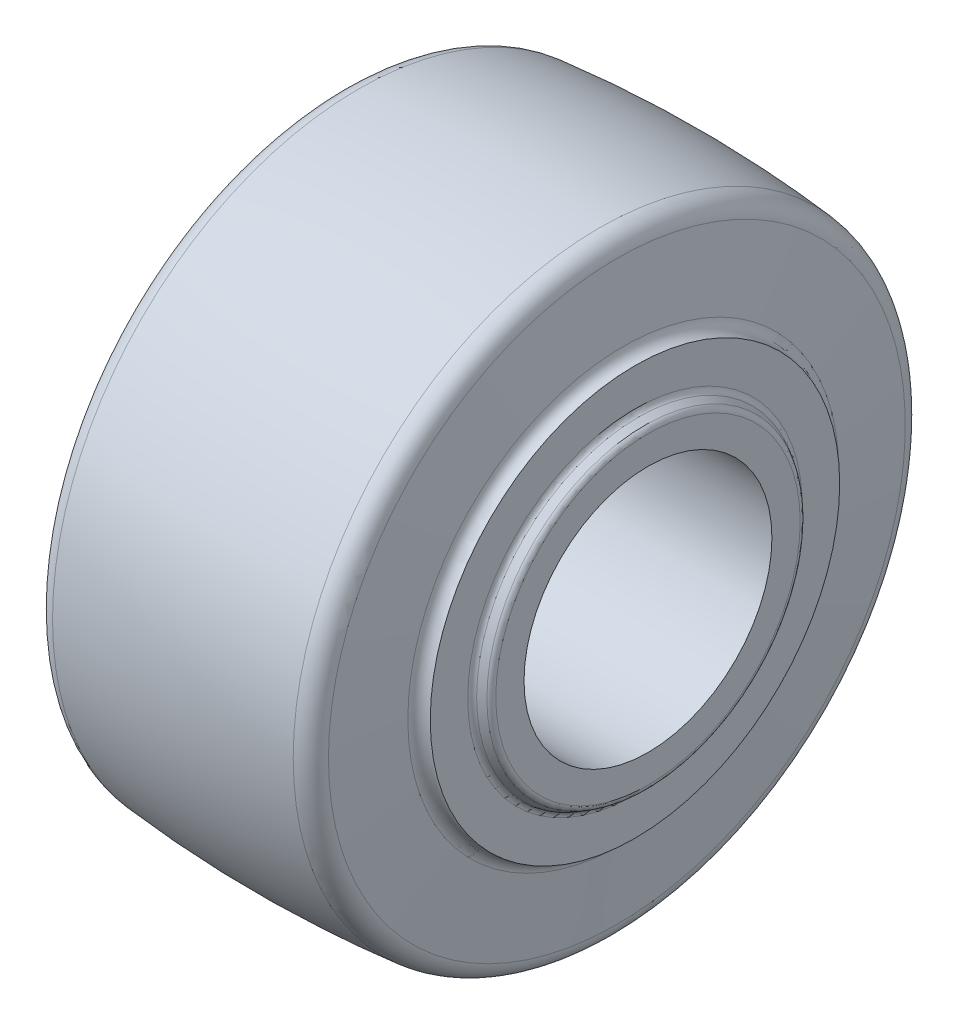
from build123d import *


with BuildPart() as part:
    # Sketch1 → Revolve1 (revolve)
    with BuildSketch(Plane.XY, mode=Mode.PRIVATE) as revolve1_sk:
        with BuildLine():
            Line((-20.6375, 15.1384), (20.6375, 15.1384))
            Line((20.6375, 15.1384), (20.6375, 18.591728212))
            ThreePointArc((20.6375, 18.591728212), (20.53115766, 18.98860322), (20.240624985, 19.279135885))
            Line((20.240624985, 19.279135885), (19.446875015, 19.737407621))
            ThreePointArc((19.446875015, 19.737407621), (19.15634234, 20.027940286), (19.05, 20.424815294))
            Line((19.05, 20.424815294), (19.05, 25.003125))
            ThreePointArc((19.05, 25.003125), (18.080174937, 25.380269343), (17.619939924, 26.313533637))
            Line((17.619939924, 26.313533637), (16.840111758, 35.227011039))
            ThreePointArc((16.840111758, 35.227011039), (16.159553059, 36.695400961), (14.697572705, 37.389621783))
            ThreePointArc((14.697572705, 37.389621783), (0, 38.1), (-14.697572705, 37.389621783))
            ThreePointArc((-14.697572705, 37.389621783), (-16.159553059, 36.695400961), (-16.840111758, 35.227011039))
            Line((-16.840111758, 35.227011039), (-17.619939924, 26.313533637))
            ThreePointArc((-17.619939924, 26.313533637), (-18.080174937, 25.380269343), (-19.05, 25.003125))
            Line((-19.05, 25.003125), (-19.05, 20.424815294))
            ThreePointArc((-19.05, 20.424815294), (-19.15634234, 20.027940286), (-19.446875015, 19.737407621))
            Line((-19.446875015, 19.737407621), (-20.240624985, 19.279135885))
            ThreePointArc((-20.240624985, 19.279135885), (-20.53115766, 18.98860322), (-20.6375, 18.591728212))
            Line((-20.6375, 18.591728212), (-20.6375, 15.1384))
        make_face()
    revolve(revolve1_sk.sketch.rotate(Axis((-38.862204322, 0, 0), (1, 0, 0)), 90), axis=Axis((-38.862204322, 0, 0), (1, 0, 0)))


solid = part.part
